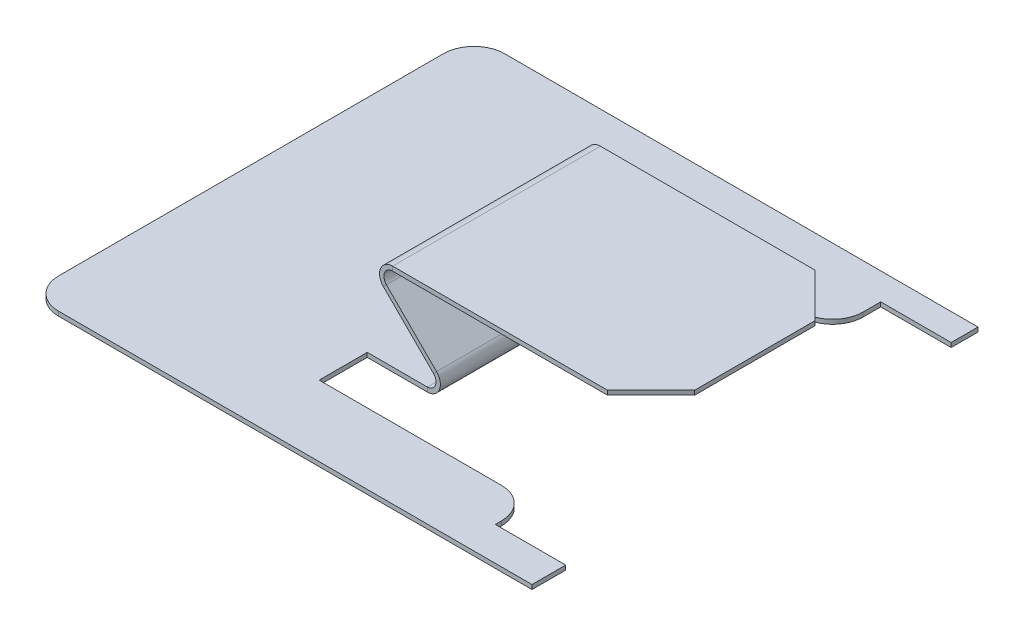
ISO-10303-21;
HEADER;
FILE_DESCRIPTION(('STEP AP214'),'2;1');
FILE_NAME('part.step','',(''),(''),'','','');
FILE_SCHEMA(('AUTOMOTIVE_DESIGN { 1 0 10303 214 1 1 1 1 }'));
ENDSEC;
DATA;
#1=APPLICATION_CONTEXT('core data for automotive mechanical design processes');
#2=APPLICATION_PROTOCOL_DEFINITION('international standard','automotive_design',2000,#1);
#3=PRODUCT_CONTEXT('',#1,'mechanical');
#4=PRODUCT('Part','Part','',(#3));
#5=PRODUCT_RELATED_PRODUCT_CATEGORY('part','',(#4));
#6=PRODUCT_DEFINITION_FORMATION('','',#4);
#7=PRODUCT_DEFINITION_CONTEXT('part definition',#1,'design');
#8=PRODUCT_DEFINITION('design','',#6,#7);
#9=PRODUCT_DEFINITION_SHAPE('','',#8);
#10=(LENGTH_UNIT() NAMED_UNIT(*) SI_UNIT(.MILLI.,.METRE.));
#11=(NAMED_UNIT(*) PLANE_ANGLE_UNIT() SI_UNIT($,.RADIAN.));
#12=(NAMED_UNIT(*) SI_UNIT($,.STERADIAN.) SOLID_ANGLE_UNIT());
#13=UNCERTAINTY_MEASURE_WITH_UNIT(LENGTH_MEASURE(1.E-05),#10,'distance_accuracy_value','');
#14=(GEOMETRIC_REPRESENTATION_CONTEXT(3) GLOBAL_UNCERTAINTY_ASSIGNED_CONTEXT((#13)) GLOBAL_UNIT_ASSIGNED_CONTEXT((#10,
#11,#12)) REPRESENTATION_CONTEXT('',''));
#15=CARTESIAN_POINT('',(0.,0.,0.));
#16=DIRECTION('',(0.,0.,1.));
#17=DIRECTION('',(1.,0.,0.));
#18=AXIS2_PLACEMENT_3D('',#15,#16,#17);
#19=CARTESIAN_POINT('',(24.2169050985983,36.4189178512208,41.4697311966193));
#20=DIRECTION('',(0.707106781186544,0.707106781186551,0.));
#21=DIRECTION('',(0.,0.,-1.));
#22=AXIS2_PLACEMENT_3D('',#19,#20,#21);
#23=PLANE('',#22);
#24=DIRECTION('',(-0.707106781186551,0.707106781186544,0.));
#25=VECTOR('',#24,1.);
#26=CARTESIAN_POINT('',(70.1039701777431,-9.46814722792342,22.0110102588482));
#27=LINE('',#26,#25);
#28=CARTESIAN_POINT('',(56.2216093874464,4.4142135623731,22.0110102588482));
#29=VERTEX_POINT('',#28);
#30=CARTESIAN_POINT('',(44.7571432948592,15.8786796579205,22.0110102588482));
#31=VERTEX_POINT('',#30);
#32=EDGE_CURVE('E434',#29,#31,#27,.T.);
#33=ORIENTED_EDGE('',*,*,#32,.T.);
#34=DIRECTION('',(0.,0.,-1.));
#35=VECTOR('',#34,1.);
#36=CARTESIAN_POINT('',(44.7571432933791,15.8786796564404,41.4697311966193));
#37=LINE('',#36,#35);
#38=CARTESIAN_POINT('',(44.7571432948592,15.8786796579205,-25.5547520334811));
#39=VERTEX_POINT('',#38);
#40=EDGE_CURVE('E273',#31,#39,#37,.T.);
#41=ORIENTED_EDGE('',*,*,#40,.T.);
#42=DIRECTION('',(0.707106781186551,-0.707106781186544,0.));
#43=VECTOR('',#42,1.);
#44=CARTESIAN_POINT('',(17.5497955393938,43.0860274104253,-25.5547520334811));
#45=LINE('',#44,#43);
#46=CARTESIAN_POINT('',(56.2216094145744,4.4142135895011,-25.5547520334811));
#47=VERTEX_POINT('',#46);
#48=EDGE_CURVE('E413',#39,#47,#45,.T.);
#49=ORIENTED_EDGE('',*,*,#48,.T.);
#50=DIRECTION('',(0.,0.,-1.));
#51=VECTOR('',#50,1.);
#52=CARTESIAN_POINT('',(56.2216093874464,4.41421356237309,41.4697311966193));
#53=LINE('',#52,#51);
#54=EDGE_CURVE('E409',#29,#47,#53,.T.);
#55=ORIENTED_EDGE('',*,*,#54,.F.);
#56=EDGE_LOOP('',(#33,#41,#49,#55));
#57=FACE_BOUND('',#56,.T.);
#58=ADVANCED_FACE('F38',(#57),#23,.F.);
#59=CARTESIAN_POINT('',(17.5497955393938,43.0860274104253,-25.5547520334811));
#60=DIRECTION('',(0.,0.,1.));
#61=DIRECTION('',(-0.707106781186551,0.707106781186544,0.));
#62=AXIS2_PLACEMENT_3D('',#59,#60,#61);
#63=PLANE('',#62);
#64=ORIENTED_EDGE('',*,*,#48,.F.);
#65=DIRECTION('',(0.707106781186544,0.707106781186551,0.));
#66=VECTOR('',#65,1.);
#67=CARTESIAN_POINT('',(44.757143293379,15.8786796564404,-25.5547520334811));
#68=LINE('',#67,#66);
#69=CARTESIAN_POINT('',(45.4642500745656,16.5857864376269,-25.5547520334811));
#70=VERTEX_POINT('',#69);
#71=EDGE_CURVE('E428',#39,#70,#68,.T.);
#72=ORIENTED_EDGE('',*,*,#71,.T.);
#73=DIRECTION('',(0.707106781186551,-0.707106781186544,0.));
#74=VECTOR('',#73,1.);
#75=CARTESIAN_POINT('',(18.2569023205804,43.7931341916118,-25.5547520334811));
#76=LINE('',#75,#74);
#77=CARTESIAN_POINT('',(56.9287161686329,5.12132034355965,-25.5547520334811));
#78=VERTEX_POINT('',#77);
#79=EDGE_CURVE('E432',#70,#78,#76,.T.);
#80=ORIENTED_EDGE('',*,*,#79,.T.);
#81=DIRECTION('',(0.707106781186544,0.707106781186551,0.));
#82=VECTOR('',#81,1.);
#83=CARTESIAN_POINT('',(56.2216093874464,4.4142135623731,-25.5547520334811));
#84=LINE('',#83,#82);
#85=EDGE_CURVE('E412',#47,#78,#84,.T.);
#86=ORIENTED_EDGE('',*,*,#85,.F.);
#87=EDGE_LOOP('',(#64,#72,#80,#86));
#88=FACE_BOUND('',#87,.T.);
#89=ADVANCED_FACE('F578',(#88),#63,.F.);
#90=CARTESIAN_POINT('',(70.1039701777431,-9.46814722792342,22.0110102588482));
#91=DIRECTION('',(0.,0.,-1.));
#92=DIRECTION('',(0.707106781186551,-0.707106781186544,0.));
#93=AXIS2_PLACEMENT_3D('',#90,#91,#92);
#94=PLANE('',#93);
#95=DIRECTION('',(-0.707106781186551,0.707106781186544,0.));
#96=VECTOR('',#95,1.);
#97=CARTESIAN_POINT('',(70.8110769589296,-8.76104044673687,22.0110102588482));
#98=LINE('',#97,#96);
#99=CARTESIAN_POINT('',(56.928716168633,5.12132034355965,22.0110102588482));
#100=VERTEX_POINT('',#99);
#101=CARTESIAN_POINT('',(45.4642500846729,16.5857864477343,22.0110102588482));
#102=VERTEX_POINT('',#101);
#103=EDGE_CURVE('E301',#100,#102,#98,.T.);
#104=ORIENTED_EDGE('',*,*,#103,.T.);
#105=DIRECTION('',(-0.707106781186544,-0.707106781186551,0.));
#106=VECTOR('',#105,1.);
#107=CARTESIAN_POINT('',(44.757143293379,15.8786796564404,22.0110102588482));
#108=LINE('',#107,#106);
#109=EDGE_CURVE('E423',#102,#31,#108,.T.);
#110=ORIENTED_EDGE('',*,*,#109,.T.);
#111=ORIENTED_EDGE('',*,*,#32,.F.);
#112=DIRECTION('',(-0.707106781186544,-0.707106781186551,0.));
#113=VECTOR('',#112,1.);
#114=CARTESIAN_POINT('',(56.2216093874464,4.4142135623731,22.0110102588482));
#115=LINE('',#114,#113);
#116=EDGE_CURVE('E419',#100,#29,#115,.T.);
#117=ORIENTED_EDGE('',*,*,#116,.F.);
#118=EDGE_LOOP('',(#104,#110,#111,#117));
#119=FACE_BOUND('',#118,.T.);
#120=ADVANCED_FACE('F584',(#119),#94,.F.);
#121=CARTESIAN_POINT('',(24.9240118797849,37.1260246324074,41.4697311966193));
#122=DIRECTION('',(0.707106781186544,0.707106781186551,0.));
#123=DIRECTION('',(0.,0.,-1.));
#124=AXIS2_PLACEMENT_3D('',#121,#122,#123);
#125=PLANE('',#124);
#126=DIRECTION('',(0.,0.,-1.));
#127=VECTOR('',#126,1.);
#128=CARTESIAN_POINT('',(45.4642500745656,16.5857864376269,41.4697311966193));
#129=LINE('',#128,#127);
#130=EDGE_CURVE('E426',#102,#70,#129,.T.);
#131=ORIENTED_EDGE('',*,*,#130,.F.);
#132=ORIENTED_EDGE('',*,*,#103,.F.);
#133=DIRECTION('',(0.,0.,-1.));
#134=VECTOR('',#133,1.);
#135=CARTESIAN_POINT('',(56.928716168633,5.12132034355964,41.4697311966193));
#136=LINE('',#135,#134);
#137=EDGE_CURVE('E416',#100,#78,#136,.T.);
#138=ORIENTED_EDGE('',*,*,#137,.T.);
#139=ORIENTED_EDGE('',*,*,#79,.F.);
#140=EDGE_LOOP('',(#131,#132,#138,#139));
#141=FACE_BOUND('',#140,.T.);
#142=ADVANCED_FACE('F592',(#141),#125,.T.);
#143=CARTESIAN_POINT('',(41.0652591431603,1.,33.0179635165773));
#144=DIRECTION('',(-1.,0.,0.));
#145=DIRECTION('',(0.,0.,1.));
#146=AXIS2_PLACEMENT_3D('',#143,#144,#145);
#147=PLANE('',#146);
#148=DIRECTION('',(0.,0.,-1.));
#149=VECTOR('',#148,1.);
#150=CARTESIAN_POINT('',(41.0652591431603,0.,33.0179635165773));
#151=LINE('',#150,#149);
#152=CARTESIAN_POINT('',(41.0652591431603,0.,33.0179635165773));
#153=VERTEX_POINT('',#152);
#154=CARTESIAN_POINT('',(41.0652591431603,0.,22.0110102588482));
#155=VERTEX_POINT('',#154);
#156=EDGE_CURVE('E406',#153,#155,#151,.T.);
#157=ORIENTED_EDGE('',*,*,#156,.T.);
#158=DIRECTION('',(0.,-1.,0.));
#159=VECTOR('',#158,1.);
#160=CARTESIAN_POINT('',(41.0652591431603,1.,22.0110102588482));
#161=LINE('',#160,#159);
#162=CARTESIAN_POINT('',(41.0652591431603,1.,22.0110102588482));
#163=VERTEX_POINT('',#162);
#164=EDGE_CURVE('E298',#163,#155,#161,.T.);
#165=ORIENTED_EDGE('',*,*,#164,.F.);
#166=DIRECTION('',(0.,0.,-1.));
#167=VECTOR('',#166,1.);
#168=CARTESIAN_POINT('',(41.0652591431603,1.,33.0179635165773));
#169=LINE('',#168,#167);
#170=CARTESIAN_POINT('',(41.0652591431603,1.,33.0179635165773));
#171=VERTEX_POINT('',#170);
#172=EDGE_CURVE('E313',#171,#163,#169,.T.);
#173=ORIENTED_EDGE('',*,*,#172,.F.);
#174=DIRECTION('',(0.,-1.,0.));
#175=VECTOR('',#174,1.);
#176=CARTESIAN_POINT('',(41.0652591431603,1.,33.0179635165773));
#177=LINE('',#176,#175);
#178=EDGE_CURVE('E403',#171,#153,#177,.T.);
#179=ORIENTED_EDGE('',*,*,#178,.T.);
#180=EDGE_LOOP('',(#157,#165,#173,#179));
#181=FACE_BOUND('',#180,.T.);
#182=ADVANCED_FACE('F500',(#181),#147,.F.);
#183=CARTESIAN_POINT('',(89.8362298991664,1.,33.0179635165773));
#184=DIRECTION('',(0.,0.,1.));
#185=DIRECTION('',(1.,0.,0.));
#186=AXIS2_PLACEMENT_3D('',#183,#184,#185);
#187=PLANE('',#186);
#188=DIRECTION('',(-1.,0.,0.));
#189=VECTOR('',#188,1.);
#190=CARTESIAN_POINT('',(89.8362298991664,1.,33.0179635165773));
#191=LINE('',#190,#189);
#192=CARTESIAN_POINT('',(82.8362298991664,1.,33.0179635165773));
#193=VERTEX_POINT('',#192);
#194=EDGE_CURVE('E315',#193,#171,#191,.T.);
#195=ORIENTED_EDGE('',*,*,#194,.F.);
#196=DIRECTION('',(0.,-1.,0.));
#197=VECTOR('',#196,1.);
#198=CARTESIAN_POINT('',(82.8362298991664,1.,33.0179635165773));
#199=LINE('',#198,#197);
#200=CARTESIAN_POINT('',(82.8362298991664,0.,33.0179635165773));
#201=VERTEX_POINT('',#200);
#202=EDGE_CURVE('E483',#193,#201,#199,.T.);
#203=ORIENTED_EDGE('',*,*,#202,.T.);
#204=DIRECTION('',(-1.,0.,0.));
#205=VECTOR('',#204,1.);
#206=CARTESIAN_POINT('',(89.8362298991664,0.,33.0179635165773));
#207=LINE('',#206,#205);
#208=EDGE_CURVE('E401',#201,#153,#207,.T.);
#209=ORIENTED_EDGE('',*,*,#208,.T.);
#210=ORIENTED_EDGE('',*,*,#178,.F.);
#211=EDGE_LOOP('',(#195,#203,#209,#210));
#212=FACE_BOUND('',#211,.T.);
#213=ADVANCED_FACE('F488',(#212),#187,.F.);
#214=CARTESIAN_POINT('',(89.8362298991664,1.,33.0179635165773));
#215=DIRECTION('',(-1.,0.,0.));
#216=DIRECTION('',(0.,0.,1.));
#217=AXIS2_PLACEMENT_3D('',#214,#215,#216);
#218=PLANE('',#217);
#219=DIRECTION('',(0.,0.,-1.));
#220=VECTOR('',#219,1.);
#221=CARTESIAN_POINT('',(89.8362298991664,0.,33.0179635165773));
#222=LINE('',#221,#220);
#223=CARTESIAN_POINT('',(89.8362298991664,0.,41.4697311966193));
#224=VERTEX_POINT('',#223);
#225=CARTESIAN_POINT('',(89.8362298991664,0.,40.0179635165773));
#226=VERTEX_POINT('',#225);
#227=EDGE_CURVE('E399',#224,#226,#222,.T.);
#228=ORIENTED_EDGE('',*,*,#227,.T.);
#229=DIRECTION('',(0.,-1.,0.));
#230=VECTOR('',#229,1.);
#231=CARTESIAN_POINT('',(89.8362298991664,1.,40.0179635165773));
#232=LINE('',#231,#230);
#233=CARTESIAN_POINT('',(89.8362298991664,1.,40.0179635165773));
#234=VERTEX_POINT('',#233);
#235=EDGE_CURVE('E46',#226,#234,#232,.F.);
#236=ORIENTED_EDGE('',*,*,#235,.T.);
#237=DIRECTION('',(0.,0.,-1.));
#238=VECTOR('',#237,1.);
#239=CARTESIAN_POINT('',(89.8362298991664,1.,33.0179635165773));
#240=LINE('',#239,#238);
#241=CARTESIAN_POINT('',(89.8362298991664,1.,41.4697311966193));
#242=VERTEX_POINT('',#241);
#243=EDGE_CURVE('E317',#242,#234,#240,.T.);
#244=ORIENTED_EDGE('',*,*,#243,.F.);
#245=DIRECTION('',(0.,-1.,0.));
#246=VECTOR('',#245,1.);
#247=CARTESIAN_POINT('',(89.8362298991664,1.,41.4697311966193));
#248=LINE('',#247,#246);
#249=EDGE_CURVE('E396',#242,#224,#248,.T.);
#250=ORIENTED_EDGE('',*,*,#249,.T.);
#251=EDGE_LOOP('',(#228,#236,#244,#250));
#252=FACE_BOUND('',#251,.T.);
#253=ADVANCED_FACE('F569',(#252),#218,.F.);
#254=CARTESIAN_POINT('',(89.8362298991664,1.,41.4697311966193));
#255=DIRECTION('',(0.,0.,1.));
#256=DIRECTION('',(1.,0.,0.));
#257=AXIS2_PLACEMENT_3D('',#254,#255,#256);
#258=PLANE('',#257);
#259=DIRECTION('',(-1.,0.,0.));
#260=VECTOR('',#259,1.);
#261=CARTESIAN_POINT('',(89.8362298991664,0.,41.4697311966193));
#262=LINE('',#261,#260);
#263=CARTESIAN_POINT('',(105.959368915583,0.,41.4697311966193));
#264=VERTEX_POINT('',#263);
#265=EDGE_CURVE('E394',#264,#224,#262,.T.);
#266=ORIENTED_EDGE('',*,*,#265,.T.);
#267=ORIENTED_EDGE('',*,*,#249,.F.);
#268=DIRECTION('',(-1.,0.,0.));
#269=VECTOR('',#268,1.);
#270=CARTESIAN_POINT('',(89.8362298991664,1.,41.4697311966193));
#271=LINE('',#270,#269);
#272=CARTESIAN_POINT('',(105.959368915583,1.,41.4697311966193));
#273=VERTEX_POINT('',#272);
#274=EDGE_CURVE('E319',#273,#242,#271,.T.);
#275=ORIENTED_EDGE('',*,*,#274,.F.);
#276=DIRECTION('',(0.,-1.,0.));
#277=VECTOR('',#276,1.);
#278=CARTESIAN_POINT('',(105.959368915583,1.,41.4697311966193));
#279=LINE('',#278,#277);
#280=EDGE_CURVE('E391',#273,#264,#279,.T.);
#281=ORIENTED_EDGE('',*,*,#280,.T.);
#282=EDGE_LOOP('',(#266,#267,#275,#281));
#283=FACE_BOUND('',#282,.T.);
#284=ADVANCED_FACE('F568',(#283),#258,.F.);
#285=CARTESIAN_POINT('',(105.959368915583,1.,49.1848728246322));
#286=DIRECTION('',(-1.,0.,0.));
#287=DIRECTION('',(0.,0.,1.));
#288=AXIS2_PLACEMENT_3D('',#285,#286,#287);
#289=PLANE('',#288);
#290=DIRECTION('',(0.,0.,-1.));
#291=VECTOR('',#290,1.);
#292=CARTESIAN_POINT('',(105.959368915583,0.,49.1848728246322));
#293=LINE('',#292,#291);
#294=CARTESIAN_POINT('',(105.959368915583,0.,49.1848728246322));
#295=VERTEX_POINT('',#294);
#296=EDGE_CURVE('E388',#295,#264,#293,.T.);
#297=ORIENTED_EDGE('',*,*,#296,.T.);
#298=ORIENTED_EDGE('',*,*,#280,.F.);
#299=DIRECTION('',(0.,0.,-1.));
#300=VECTOR('',#299,1.);
#301=CARTESIAN_POINT('',(105.959368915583,1.,49.1848728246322));
#302=LINE('',#301,#300);
#303=CARTESIAN_POINT('',(105.959368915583,1.,49.1848728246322));
#304=VERTEX_POINT('',#303);
#305=EDGE_CURVE('E321',#304,#273,#302,.T.);
#306=ORIENTED_EDGE('',*,*,#305,.F.);
#307=DIRECTION('',(0.,-1.,0.));
#308=VECTOR('',#307,1.);
#309=CARTESIAN_POINT('',(105.959368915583,1.,49.1848728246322));
#310=LINE('',#309,#308);
#311=EDGE_CURVE('E385',#304,#295,#310,.T.);
#312=ORIENTED_EDGE('',*,*,#311,.T.);
#313=EDGE_LOOP('',(#297,#298,#306,#312));
#314=FACE_BOUND('',#313,.T.);
#315=ADVANCED_FACE('F566',(#314),#289,.F.);
#316=CARTESIAN_POINT('',(105.959368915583,1.,49.1848728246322));
#317=DIRECTION('',(0.,0.,-1.));
#318=DIRECTION('',(-1.,0.,0.));
#319=AXIS2_PLACEMENT_3D('',#316,#317,#318);
#320=PLANE('',#319);
#321=DIRECTION('',(1.,0.,0.));
#322=VECTOR('',#321,1.);
#323=CARTESIAN_POINT('',(105.959368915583,1.,49.1848728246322));
#324=LINE('',#323,#322);
#325=CARTESIAN_POINT('',(-2.42871676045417,1.,49.1848728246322));
#326=VERTEX_POINT('',#325);
#327=EDGE_CURVE('E324',#326,#304,#324,.T.);
#328=ORIENTED_EDGE('',*,*,#327,.F.);
#329=DIRECTION('',(0.,-1.,0.));
#330=VECTOR('',#329,1.);
#331=CARTESIAN_POINT('',(-2.4287167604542,1.,49.1848728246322));
#332=LINE('',#331,#330);
#333=CARTESIAN_POINT('',(-2.42871676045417,0.,49.1848728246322));
#334=VERTEX_POINT('',#333);
#335=EDGE_CURVE('E12',#326,#334,#332,.T.);
#336=ORIENTED_EDGE('',*,*,#335,.T.);
#337=DIRECTION('',(1.,0.,0.));
#338=VECTOR('',#337,1.);
#339=CARTESIAN_POINT('',(105.959368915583,0.,49.1848728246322));
#340=LINE('',#339,#338);
#341=EDGE_CURVE('E383',#334,#295,#340,.T.);
#342=ORIENTED_EDGE('',*,*,#341,.T.);
#343=ORIENTED_EDGE('',*,*,#311,.F.);
#344=EDGE_LOOP('',(#328,#336,#342,#343));
#345=FACE_BOUND('',#344,.T.);
#346=ADVANCED_FACE('F560',(#345),#320,.F.);
#347=CARTESIAN_POINT('',(-9.4287167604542,1.,49.1848728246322));
#348=DIRECTION('',(1.,0.,0.));
#349=DIRECTION('',(0.,0.,-1.));
#350=AXIS2_PLACEMENT_3D('',#347,#348,#349);
#351=PLANE('',#350);
#352=DIRECTION('',(0.,0.,1.));
#353=VECTOR('',#352,1.);
#354=CARTESIAN_POINT('',(-9.4287167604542,1.,49.1848728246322));
#355=LINE('',#354,#353);
#356=CARTESIAN_POINT('',(-9.4287167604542,1.,-45.9251673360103));
#357=VERTEX_POINT('',#356);
#358=CARTESIAN_POINT('',(-9.4287167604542,1.,42.1848728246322));
#359=VERTEX_POINT('',#358);
#360=EDGE_CURVE('E326',#357,#359,#355,.T.);
#361=ORIENTED_EDGE('',*,*,#360,.F.);
#362=DIRECTION('',(0.,-1.,0.));
#363=VECTOR('',#362,1.);
#364=CARTESIAN_POINT('',(-9.4287167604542,1.,-45.9251673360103));
#365=LINE('',#364,#363);
#366=CARTESIAN_POINT('',(-9.4287167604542,0.,-45.9251673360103));
#367=VERTEX_POINT('',#366);
#368=EDGE_CURVE('E458',#357,#367,#365,.T.);
#369=ORIENTED_EDGE('',*,*,#368,.T.);
#370=DIRECTION('',(0.,0.,1.));
#371=VECTOR('',#370,1.);
#372=CARTESIAN_POINT('',(-9.4287167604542,0.,49.1848728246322));
#373=LINE('',#372,#371);
#374=CARTESIAN_POINT('',(-9.4287167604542,0.,42.1848728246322));
#375=VERTEX_POINT('',#374);
#376=EDGE_CURVE('E380',#367,#375,#373,.T.);
#377=ORIENTED_EDGE('',*,*,#376,.T.);
#378=DIRECTION('',(0.,-1.,0.));
#379=VECTOR('',#378,1.);
#380=CARTESIAN_POINT('',(-9.4287167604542,1.,42.1848728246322));
#381=LINE('',#380,#379);
#382=EDGE_CURVE('E456',#375,#359,#381,.F.);
#383=ORIENTED_EDGE('',*,*,#382,.T.);
#384=EDGE_LOOP('',(#361,#369,#377,#383));
#385=FACE_BOUND('',#384,.T.);
#386=ADVANCED_FACE('F551',(#385),#351,.F.);
#387=CARTESIAN_POINT('',(105.959368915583,1.,-52.9251673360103));
#388=DIRECTION('',(0.,0.,1.));
#389=DIRECTION('',(1.,0.,0.));
#390=AXIS2_PLACEMENT_3D('',#387,#388,#389);
#391=PLANE('',#390);
#392=DIRECTION('',(-1.,0.,0.));
#393=VECTOR('',#392,1.);
#394=CARTESIAN_POINT('',(105.959368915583,0.,-52.9251673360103));
#395=LINE('',#394,#393);
#396=CARTESIAN_POINT('',(105.959368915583,0.,-52.9251673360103));
#397=VERTEX_POINT('',#396);
#398=CARTESIAN_POINT('',(-2.42871676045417,0.,-52.9251673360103));
#399=VERTEX_POINT('',#398);
#400=EDGE_CURVE('E377',#397,#399,#395,.T.);
#401=ORIENTED_EDGE('',*,*,#400,.T.);
#402=DIRECTION('',(0.,-1.,0.));
#403=VECTOR('',#402,1.);
#404=CARTESIAN_POINT('',(-2.4287167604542,1.,-52.9251673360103));
#405=LINE('',#404,#403);
#406=CARTESIAN_POINT('',(-2.42871676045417,1.,-52.9251673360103));
#407=VERTEX_POINT('',#406);
#408=EDGE_CURVE('E469',#399,#407,#405,.F.);
#409=ORIENTED_EDGE('',*,*,#408,.T.);
#410=DIRECTION('',(-1.,0.,0.));
#411=VECTOR('',#410,1.);
#412=CARTESIAN_POINT('',(105.959368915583,1.,-52.9251673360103));
#413=LINE('',#412,#411);
#414=CARTESIAN_POINT('',(105.959368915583,1.,-52.9251673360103));
#415=VERTEX_POINT('',#414);
#416=EDGE_CURVE('E329',#415,#407,#413,.T.);
#417=ORIENTED_EDGE('',*,*,#416,.F.);
#418=DIRECTION('',(0.,-1.,0.));
#419=VECTOR('',#418,1.);
#420=CARTESIAN_POINT('',(105.959368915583,1.,-52.9251673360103));
#421=LINE('',#420,#419);
#422=EDGE_CURVE('E374',#415,#397,#421,.T.);
#423=ORIENTED_EDGE('',*,*,#422,.T.);
#424=EDGE_LOOP('',(#401,#409,#417,#423));
#425=FACE_BOUND('',#424,.T.);
#426=ADVANCED_FACE('F850',(#425),#391,.F.);
#427=CARTESIAN_POINT('',(105.959368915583,1.,-46.7824476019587));
#428=DIRECTION('',(-1.,0.,0.));
#429=DIRECTION('',(0.,0.,1.));
#430=AXIS2_PLACEMENT_3D('',#427,#428,#429);
#431=PLANE('',#430);
#432=DIRECTION('',(0.,0.,-1.));
#433=VECTOR('',#432,1.);
#434=CARTESIAN_POINT('',(105.959368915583,0.,-46.7824476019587));
#435=LINE('',#434,#433);
#436=CARTESIAN_POINT('',(105.959368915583,0.,-46.7824476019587));
#437=VERTEX_POINT('',#436);
#438=EDGE_CURVE('E372',#437,#397,#435,.T.);
#439=ORIENTED_EDGE('',*,*,#438,.T.);
#440=ORIENTED_EDGE('',*,*,#422,.F.);
#441=DIRECTION('',(0.,0.,-1.));
#442=VECTOR('',#441,1.);
#443=CARTESIAN_POINT('',(105.959368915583,1.,-46.7824476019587));
#444=LINE('',#443,#442);
#445=CARTESIAN_POINT('',(105.959368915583,1.,-46.7824476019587));
#446=VERTEX_POINT('',#445);
#447=EDGE_CURVE('E332',#446,#415,#444,.T.);
#448=ORIENTED_EDGE('',*,*,#447,.F.);
#449=DIRECTION('',(0.,-1.,0.));
#450=VECTOR('',#449,1.);
#451=CARTESIAN_POINT('',(105.959368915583,1.,-46.7824476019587));
#452=LINE('',#451,#450);
#453=EDGE_CURVE('E369',#446,#437,#452,.T.);
#454=ORIENTED_EDGE('',*,*,#453,.T.);
#455=EDGE_LOOP('',(#439,#440,#448,#454));
#456=FACE_BOUND('',#455,.T.);
#457=ADVANCED_FACE('F540',(#456),#431,.F.);
#458=CARTESIAN_POINT('',(89.8362298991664,1.,-46.7824476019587));
#459=DIRECTION('',(0.,0.,-1.));
#460=DIRECTION('',(-1.,0.,0.));
#461=AXIS2_PLACEMENT_3D('',#458,#459,#460);
#462=PLANE('',#461);
#463=DIRECTION('',(1.,0.,0.));
#464=VECTOR('',#463,1.);
#465=CARTESIAN_POINT('',(89.8362298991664,0.,-46.7824476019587));
#466=LINE('',#465,#464);
#467=CARTESIAN_POINT('',(89.8362298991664,0.,-46.7824476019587));
#468=VERTEX_POINT('',#467);
#469=EDGE_CURVE('E367',#468,#437,#466,.T.);
#470=ORIENTED_EDGE('',*,*,#469,.T.);
#471=ORIENTED_EDGE('',*,*,#453,.F.);
#472=DIRECTION('',(1.,0.,0.));
#473=VECTOR('',#472,1.);
#474=CARTESIAN_POINT('',(89.8362298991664,1.,-46.7824476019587));
#475=LINE('',#474,#473);
#476=CARTESIAN_POINT('',(89.8362298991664,1.,-46.7824476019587));
#477=VERTEX_POINT('',#476);
#478=EDGE_CURVE('E334',#477,#446,#475,.T.);
#479=ORIENTED_EDGE('',*,*,#478,.F.);
#480=DIRECTION('',(0.,-1.,0.));
#481=VECTOR('',#480,1.);
#482=CARTESIAN_POINT('',(89.8362298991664,1.,-46.7824476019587));
#483=LINE('',#482,#481);
#484=EDGE_CURVE('E364',#477,#468,#483,.T.);
#485=ORIENTED_EDGE('',*,*,#484,.T.);
#486=EDGE_LOOP('',(#470,#471,#479,#485));
#487=FACE_BOUND('',#486,.T.);
#488=ADVANCED_FACE('F536',(#487),#462,.F.);
#489=CARTESIAN_POINT('',(89.8362298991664,1.,-35.7754943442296));
#490=DIRECTION('',(-1.,0.,0.));
#491=DIRECTION('',(0.,0.,1.));
#492=AXIS2_PLACEMENT_3D('',#489,#490,#491);
#493=PLANE('',#492);
#494=DIRECTION('',(0.,0.,-1.));
#495=VECTOR('',#494,1.);
#496=CARTESIAN_POINT('',(89.8362298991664,1.,-35.7754943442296));
#497=LINE('',#496,#495);
#498=CARTESIAN_POINT('',(89.8362298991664,1.,-42.7754943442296));
#499=VERTEX_POINT('',#498);
#500=EDGE_CURVE('E336',#499,#477,#497,.T.);
#501=ORIENTED_EDGE('',*,*,#500,.F.);
#502=DIRECTION('',(0.,-1.,0.));
#503=VECTOR('',#502,1.);
#504=CARTESIAN_POINT('',(89.8362298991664,1.,-42.7754943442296));
#505=LINE('',#504,#503);
#506=CARTESIAN_POINT('',(89.8362298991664,0.,-42.7754943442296));
#507=VERTEX_POINT('',#506);
#508=EDGE_CURVE('E478',#499,#507,#505,.T.);
#509=ORIENTED_EDGE('',*,*,#508,.T.);
#510=DIRECTION('',(0.,0.,-1.));
#511=VECTOR('',#510,1.);
#512=CARTESIAN_POINT('',(89.8362298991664,0.,-35.7754943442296));
#513=LINE('',#512,#511);
#514=EDGE_CURVE('E362',#507,#468,#513,.T.);
#515=ORIENTED_EDGE('',*,*,#514,.T.);
#516=ORIENTED_EDGE('',*,*,#484,.F.);
#517=EDGE_LOOP('',(#501,#509,#515,#516));
#518=FACE_BOUND('',#517,.T.);
#519=ADVANCED_FACE('F528',(#518),#493,.F.);
#520=CARTESIAN_POINT('',(41.0652591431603,1.,-35.7754943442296));
#521=DIRECTION('',(0.,0.,-1.));
#522=DIRECTION('',(-1.,0.,0.));
#523=AXIS2_PLACEMENT_3D('',#520,#521,#522);
#524=PLANE('',#523);
#525=DIRECTION('',(1.,0.,0.));
#526=VECTOR('',#525,1.);
#527=CARTESIAN_POINT('',(41.0652591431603,0.,-35.7754943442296));
#528=LINE('',#527,#526);
#529=CARTESIAN_POINT('',(41.0652591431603,0.,-35.7754943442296));
#530=VERTEX_POINT('',#529);
#531=CARTESIAN_POINT('',(82.8362298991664,0.,-35.7754943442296));
#532=VERTEX_POINT('',#531);
#533=EDGE_CURVE('E359',#530,#532,#528,.T.);
#534=ORIENTED_EDGE('',*,*,#533,.T.);
#535=DIRECTION('',(0.,-1.,0.));
#536=VECTOR('',#535,1.);
#537=CARTESIAN_POINT('',(82.8362298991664,1.,-35.7754943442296));
#538=LINE('',#537,#536);
#539=CARTESIAN_POINT('',(82.8362298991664,1.,-35.7754943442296));
#540=VERTEX_POINT('',#539);
#541=EDGE_CURVE('E481',#532,#540,#538,.F.);
#542=ORIENTED_EDGE('',*,*,#541,.T.);
#543=DIRECTION('',(1.,0.,0.));
#544=VECTOR('',#543,1.);
#545=CARTESIAN_POINT('',(41.0652591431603,1.,-35.7754943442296));
#546=LINE('',#545,#544);
#547=CARTESIAN_POINT('',(41.0652591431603,1.,-35.7754943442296));
#548=VERTEX_POINT('',#547);
#549=EDGE_CURVE('E338',#548,#540,#546,.T.);
#550=ORIENTED_EDGE('',*,*,#549,.F.);
#551=DIRECTION('',(0.,-1.,0.));
#552=VECTOR('',#551,1.);
#553=CARTESIAN_POINT('',(41.0652591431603,1.,-35.7754943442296));
#554=LINE('',#553,#552);
#555=EDGE_CURVE('E356',#548,#530,#554,.T.);
#556=ORIENTED_EDGE('',*,*,#555,.T.);
#557=EDGE_LOOP('',(#534,#542,#550,#556));
#558=FACE_BOUND('',#557,.T.);
#559=ADVANCED_FACE('F812',(#558),#524,.F.);
#560=CARTESIAN_POINT('',(41.0652591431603,1.,-25.5547520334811));
#561=DIRECTION('',(-1.,0.,0.));
#562=DIRECTION('',(0.,0.,1.));
#563=AXIS2_PLACEMENT_3D('',#560,#561,#562);
#564=PLANE('',#563);
#565=DIRECTION('',(0.,0.,-1.));
#566=VECTOR('',#565,1.);
#567=CARTESIAN_POINT('',(41.0652591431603,0.,-25.5547520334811));
#568=LINE('',#567,#566);
#569=CARTESIAN_POINT('',(41.0652591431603,0.,-25.5547520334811));
#570=VERTEX_POINT('',#569);
#571=EDGE_CURVE('E354',#570,#530,#568,.T.);
#572=ORIENTED_EDGE('',*,*,#571,.T.);
#573=ORIENTED_EDGE('',*,*,#555,.F.);
#574=DIRECTION('',(0.,0.,-1.));
#575=VECTOR('',#574,1.);
#576=CARTESIAN_POINT('',(41.0652591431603,1.,-25.5547520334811));
#577=LINE('',#576,#575);
#578=CARTESIAN_POINT('',(41.0652591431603,1.,-25.5547520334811));
#579=VERTEX_POINT('',#578);
#580=EDGE_CURVE('E341',#579,#548,#577,.T.);
#581=ORIENTED_EDGE('',*,*,#580,.F.);
#582=DIRECTION('',(0.,-1.,0.));
#583=VECTOR('',#582,1.);
#584=CARTESIAN_POINT('',(41.0652591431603,1.,-25.5547520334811));
#585=LINE('',#584,#583);
#586=EDGE_CURVE('E351',#579,#570,#585,.T.);
#587=ORIENTED_EDGE('',*,*,#586,.T.);
#588=EDGE_LOOP('',(#572,#573,#581,#587));
#589=FACE_BOUND('',#588,.T.);
#590=ADVANCED_FACE('F517',(#589),#564,.F.);
#591=CARTESIAN_POINT('',(105.959368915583,1.,41.4697311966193));
#592=DIRECTION('',(0.,-1.,0.));
#593=DIRECTION('',(0.,0.,-1.));
#594=AXIS2_PLACEMENT_3D('',#591,#592,#593);
#595=PLANE('',#594);
#596=ORIENTED_EDGE('',*,*,#416,.T.);
#597=CARTESIAN_POINT('',(-2.4287167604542,1.,-45.9251673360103));
#598=DIRECTION('',(0.,-1.,0.));
#599=DIRECTION('',(0.,0.,-1.));
#600=AXIS2_PLACEMENT_3D('',#597,#598,#599);
#601=CIRCLE('',#600,7.);
#602=EDGE_CURVE('E476',#407,#357,#601,.F.);
#603=ORIENTED_EDGE('',*,*,#602,.T.);
#604=ORIENTED_EDGE('',*,*,#360,.T.);
#605=CARTESIAN_POINT('',(-2.4287167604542,1.,42.1848728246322));
#606=DIRECTION('',(0.,-1.,0.));
#607=DIRECTION('',(0.,0.,-1.));
#608=AXIS2_PLACEMENT_3D('',#605,#606,#607);
#609=CIRCLE('',#608,7.);
#610=EDGE_CURVE('E471',#359,#326,#609,.F.);
#611=ORIENTED_EDGE('',*,*,#610,.T.);
#612=ORIENTED_EDGE('',*,*,#327,.T.);
#613=ORIENTED_EDGE('',*,*,#305,.T.);
#614=ORIENTED_EDGE('',*,*,#274,.T.);
#615=ORIENTED_EDGE('',*,*,#243,.T.);
#616=CARTESIAN_POINT('',(82.8362298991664,1.,40.0179635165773));
#617=DIRECTION('',(0.,-1.,0.));
#618=DIRECTION('',(0.,0.,-1.));
#619=AXIS2_PLACEMENT_3D('',#616,#617,#618);
#620=CIRCLE('',#619,7.);
#621=EDGE_CURVE('E53',#234,#193,#620,.F.);
#622=ORIENTED_EDGE('',*,*,#621,.T.);
#623=ORIENTED_EDGE('',*,*,#194,.T.);
#624=ORIENTED_EDGE('',*,*,#172,.T.);
#625=DIRECTION('',(1.,0.,0.));
#626=VECTOR('',#625,1.);
#627=CARTESIAN_POINT('',(41.0652591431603,1.,22.0110102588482));
#628=LINE('',#627,#626);
#629=CARTESIAN_POINT('',(54.8073958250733,0.999999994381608,22.0110102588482));
#630=VERTEX_POINT('',#629);
#631=EDGE_CURVE('E348',#163,#630,#628,.T.);
#632=ORIENTED_EDGE('',*,*,#631,.T.);
#633=DIRECTION('',(0.,0.,-1.));
#634=VECTOR('',#633,1.);
#635=CARTESIAN_POINT('',(54.8073958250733,1.,41.4697311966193));
#636=LINE('',#635,#634);
#637=CARTESIAN_POINT('',(54.8073958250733,0.999999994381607,-25.5547520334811));
#638=VERTEX_POINT('',#637);
#639=EDGE_CURVE('E345',#630,#638,#636,.T.);
#640=ORIENTED_EDGE('',*,*,#639,.T.);
#641=DIRECTION('',(-1.,0.,0.));
#642=VECTOR('',#641,1.);
#643=CARTESIAN_POINT('',(115.388085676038,1.,-25.5547520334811));
#644=LINE('',#643,#642);
#645=EDGE_CURVE('E343',#638,#579,#644,.T.);
#646=ORIENTED_EDGE('',*,*,#645,.T.);
#647=ORIENTED_EDGE('',*,*,#580,.T.);
#648=ORIENTED_EDGE('',*,*,#549,.T.);
#649=CARTESIAN_POINT('',(82.8362298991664,1.,-42.7754943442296));
#650=DIRECTION('',(0.,-1.,0.));
#651=DIRECTION('',(0.,0.,-1.));
#652=AXIS2_PLACEMENT_3D('',#649,#650,#651);
#653=CIRCLE('',#652,7.);
#654=EDGE_CURVE('E474',#540,#499,#653,.F.);
#655=ORIENTED_EDGE('',*,*,#654,.T.);
#656=ORIENTED_EDGE('',*,*,#500,.T.);
#657=ORIENTED_EDGE('',*,*,#478,.T.);
#658=ORIENTED_EDGE('',*,*,#447,.T.);
#659=EDGE_LOOP('',(#596,#603,#604,#611,#612,#613,#614,#615,#622,#623,#624,#632,#640,#646,#647,
#648,#655,#656,#657,#658));
#660=FACE_BOUND('',#659,.T.);
#661=ADVANCED_FACE('F505',(#660),#595,.F.);
#662=CARTESIAN_POINT('',(115.388085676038,1.,-25.5547520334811));
#663=DIRECTION('',(0.,0.,1.));
#664=DIRECTION('',(1.,0.,0.));
#665=AXIS2_PLACEMENT_3D('',#662,#663,#664);
#666=PLANE('',#665);
#667=ORIENTED_EDGE('',*,*,#645,.F.);
#668=DIRECTION('',(0.,-1.,0.));
#669=VECTOR('',#668,1.);
#670=CARTESIAN_POINT('',(54.8073958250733,1.,-25.5547520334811));
#671=LINE('',#670,#669);
#672=CARTESIAN_POINT('',(54.8073958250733,0.,-25.5547520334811));
#673=VERTEX_POINT('',#672);
#674=EDGE_CURVE('E310',#638,#673,#671,.T.);
#675=ORIENTED_EDGE('',*,*,#674,.T.);
#676=DIRECTION('',(-1.,0.,0.));
#677=VECTOR('',#676,1.);
#678=CARTESIAN_POINT('',(115.388085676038,0.,-25.5547520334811));
#679=LINE('',#678,#677);
#680=EDGE_CURVE('E308',#673,#570,#679,.T.);
#681=ORIENTED_EDGE('',*,*,#680,.T.);
#682=ORIENTED_EDGE('',*,*,#586,.F.);
#683=EDGE_LOOP('',(#667,#675,#681,#682));
#684=FACE_BOUND('',#683,.T.);
#685=ADVANCED_FACE('F511',(#684),#666,.F.);
#686=CARTESIAN_POINT('',(105.959368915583,0.,41.4697311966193));
#687=DIRECTION('',(0.,-1.,0.));
#688=DIRECTION('',(0.,0.,-1.));
#689=AXIS2_PLACEMENT_3D('',#686,#687,#688);
#690=PLANE('',#689);
#691=ORIENTED_EDGE('',*,*,#376,.F.);
#692=CARTESIAN_POINT('',(-2.4287167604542,0.,-45.9251673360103));
#693=DIRECTION('',(0.,-1.,0.));
#694=DIRECTION('',(0.,0.,-1.));
#695=AXIS2_PLACEMENT_3D('',#692,#693,#694);
#696=CIRCLE('',#695,7.);
#697=EDGE_CURVE('E467',#367,#399,#696,.T.);
#698=ORIENTED_EDGE('',*,*,#697,.T.);
#699=ORIENTED_EDGE('',*,*,#400,.F.);
#700=ORIENTED_EDGE('',*,*,#438,.F.);
#701=ORIENTED_EDGE('',*,*,#469,.F.);
#702=ORIENTED_EDGE('',*,*,#514,.F.);
#703=CARTESIAN_POINT('',(82.8362298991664,0.,-42.7754943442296));
#704=DIRECTION('',(0.,-1.,0.));
#705=DIRECTION('',(0.,0.,-1.));
#706=AXIS2_PLACEMENT_3D('',#703,#704,#705);
#707=CIRCLE('',#706,7.);
#708=EDGE_CURVE('E465',#507,#532,#707,.T.);
#709=ORIENTED_EDGE('',*,*,#708,.T.);
#710=ORIENTED_EDGE('',*,*,#533,.F.);
#711=ORIENTED_EDGE('',*,*,#571,.F.);
#712=ORIENTED_EDGE('',*,*,#680,.F.);
#713=DIRECTION('',(0.,0.,-1.));
#714=VECTOR('',#713,1.);
#715=CARTESIAN_POINT('',(54.8073958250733,0.,41.4697311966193));
#716=LINE('',#715,#714);
#717=CARTESIAN_POINT('',(54.8073958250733,-3.83647961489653E-08,22.0110102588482));
#718=VERTEX_POINT('',#717);
#719=EDGE_CURVE('E293',#718,#673,#716,.T.);
#720=ORIENTED_EDGE('',*,*,#719,.F.);
#721=DIRECTION('',(1.,0.,0.));
#722=VECTOR('',#721,1.);
#723=CARTESIAN_POINT('',(41.0652591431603,0.,22.0110102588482));
#724=LINE('',#723,#722);
#725=EDGE_CURVE('E305',#155,#718,#724,.T.);
#726=ORIENTED_EDGE('',*,*,#725,.F.);
#727=ORIENTED_EDGE('',*,*,#156,.F.);
#728=ORIENTED_EDGE('',*,*,#208,.F.);
#729=CARTESIAN_POINT('',(82.8362298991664,0.,40.0179635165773));
#730=DIRECTION('',(0.,-1.,0.));
#731=DIRECTION('',(0.,0.,-1.));
#732=AXIS2_PLACEMENT_3D('',#729,#730,#731);
#733=CIRCLE('',#732,7.);
#734=EDGE_CURVE('E463',#201,#226,#733,.T.);
#735=ORIENTED_EDGE('',*,*,#734,.T.);
#736=ORIENTED_EDGE('',*,*,#227,.F.);
#737=ORIENTED_EDGE('',*,*,#265,.F.);
#738=ORIENTED_EDGE('',*,*,#296,.F.);
#739=ORIENTED_EDGE('',*,*,#341,.F.);
#740=CARTESIAN_POINT('',(-2.4287167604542,0.,42.1848728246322));
#741=DIRECTION('',(0.,-1.,0.));
#742=DIRECTION('',(0.,0.,-1.));
#743=AXIS2_PLACEMENT_3D('',#740,#741,#742);
#744=CIRCLE('',#743,7.);
#745=EDGE_CURVE('E461',#334,#375,#744,.T.);
#746=ORIENTED_EDGE('',*,*,#745,.T.);
#747=EDGE_LOOP('',(#691,#698,#699,#700,#701,#702,#709,#710,#711,#712,#720,#726,#727,#728,#735,
#736,#737,#738,#739,#746));
#748=FACE_BOUND('',#747,.T.);
#749=ADVANCED_FACE('F494',(#748),#690,.T.);
#750=CARTESIAN_POINT('',(41.0652591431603,1.,22.0110102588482));
#751=DIRECTION('',(0.,0.,-1.));
#752=DIRECTION('',(-1.,0.,0.));
#753=AXIS2_PLACEMENT_3D('',#750,#751,#752);
#754=PLANE('',#753);
#755=ORIENTED_EDGE('',*,*,#725,.T.);
#756=DIRECTION('',(0.,1.,0.));
#757=VECTOR('',#756,1.);
#758=CARTESIAN_POINT('',(54.8073958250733,1.,22.0110102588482));
#759=LINE('',#758,#757);
#760=EDGE_CURVE('E302',#718,#630,#759,.T.);
#761=ORIENTED_EDGE('',*,*,#760,.T.);
#762=ORIENTED_EDGE('',*,*,#631,.F.);
#763=ORIENTED_EDGE('',*,*,#164,.T.);
#764=EDGE_LOOP('',(#755,#761,#762,#763));
#765=FACE_BOUND('',#764,.T.);
#766=ADVANCED_FACE('F504',(#765),#754,.F.);
#767=CARTESIAN_POINT('',(54.8073958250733,3.0000000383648,22.0110102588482));
#768=DIRECTION('',(0.,0.,-1.));
#769=DIRECTION('',(-1.,0.,0.));
#770=AXIS2_PLACEMENT_3D('',#767,#768,#769);
#771=PLANE('',#770);
#772=ORIENTED_EDGE('',*,*,#760,.F.);
#773=CARTESIAN_POINT('',(54.8073958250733,3.,22.0110102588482));
#774=DIRECTION('',(0.,0.,-1.));
#775=DIRECTION('',(-1.,0.,0.));
#776=AXIS2_PLACEMENT_3D('',#773,#774,#775);
#777=CIRCLE('',#776,3.0000000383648);
#778=EDGE_CURVE('E278',#718,#100,#777,.F.);
#779=ORIENTED_EDGE('',*,*,#778,.T.);
#780=ORIENTED_EDGE('',*,*,#116,.T.);
#781=CARTESIAN_POINT('',(54.8073958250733,3.0000000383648,22.0110102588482));
#782=DIRECTION('',(0.,0.,1.));
#783=DIRECTION('',(1.,0.,0.));
#784=AXIS2_PLACEMENT_3D('',#781,#782,#783);
#785=CIRCLE('',#784,2.00000004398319);
#786=EDGE_CURVE('E286',#630,#29,#785,.T.);
#787=ORIENTED_EDGE('',*,*,#786,.F.);
#788=EDGE_LOOP('',(#772,#779,#780,#787));
#789=FACE_BOUND('',#788,.T.);
#790=ADVANCED_FACE('F762',(#789),#771,.F.);
#791=CARTESIAN_POINT('',(54.8073958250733,3.0000000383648,-25.5547520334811));
#792=DIRECTION('',(0.,0.,1.));
#793=DIRECTION('',(1.,0.,0.));
#794=AXIS2_PLACEMENT_3D('',#791,#792,#793);
#795=PLANE('',#794);
#796=ORIENTED_EDGE('',*,*,#85,.T.);
#797=CARTESIAN_POINT('',(54.8073958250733,3.,-25.5547520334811));
#798=DIRECTION('',(0.,0.,-1.));
#799=DIRECTION('',(-1.,0.,0.));
#800=AXIS2_PLACEMENT_3D('',#797,#798,#799);
#801=CIRCLE('',#800,3.0000000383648);
#802=EDGE_CURVE('E290',#78,#673,#801,.T.);
#803=ORIENTED_EDGE('',*,*,#802,.T.);
#804=ORIENTED_EDGE('',*,*,#674,.F.);
#805=CARTESIAN_POINT('',(54.8073958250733,3.0000000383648,-25.5547520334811));
#806=DIRECTION('',(0.,0.,-1.));
#807=DIRECTION('',(-1.,0.,0.));
#808=AXIS2_PLACEMENT_3D('',#805,#806,#807);
#809=CIRCLE('',#808,2.00000004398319);
#810=EDGE_CURVE('E289',#47,#638,#809,.T.);
#811=ORIENTED_EDGE('',*,*,#810,.F.);
#812=EDGE_LOOP('',(#796,#803,#804,#811));
#813=FACE_BOUND('',#812,.T.);
#814=ADVANCED_FACE('F753',(#813),#795,.F.);
#815=CARTESIAN_POINT('',(54.8073958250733,3.,46.1676698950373));
#816=DIRECTION('',(0.,0.,-1.));
#817=DIRECTION('',(-1.,0.,0.));
#818=AXIS2_PLACEMENT_3D('',#815,#816,#817);
#819=CYLINDRICAL_SURFACE('',#818,2.0000000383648);
#820=ORIENTED_EDGE('',*,*,#810,.T.);
#821=ORIENTED_EDGE('',*,*,#639,.F.);
#822=ORIENTED_EDGE('',*,*,#786,.T.);
#823=ORIENTED_EDGE('',*,*,#54,.T.);
#824=EDGE_LOOP('',(#820,#821,#822,#823));
#825=FACE_BOUND('',#824,.T.);
#826=ADVANCED_FACE('F743',(#825),#819,.F.);
#827=CARTESIAN_POINT('',(54.8073958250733,3.,46.1676698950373));
#828=DIRECTION('',(0.,0.,-1.));
#829=DIRECTION('',(-1.,0.,0.));
#830=AXIS2_PLACEMENT_3D('',#827,#828,#829);
#831=CYLINDRICAL_SURFACE('',#830,3.0000000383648);
#832=ORIENTED_EDGE('',*,*,#802,.F.);
#833=ORIENTED_EDGE('',*,*,#137,.F.);
#834=ORIENTED_EDGE('',*,*,#778,.F.);
#835=ORIENTED_EDGE('',*,*,#719,.T.);
#836=EDGE_LOOP('',(#832,#833,#834,#835));
#837=FACE_BOUND('',#836,.T.);
#838=ADVANCED_FACE('F734',(#837),#831,.T.);
#839=CARTESIAN_POINT('',(46.8784636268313,17.9999999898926,22.0110102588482));
#840=DIRECTION('',(0.,0.,1.));
#841=DIRECTION('',(1.,0.,0.));
#842=AXIS2_PLACEMENT_3D('',#839,#840,#841);
#843=PLANE('',#842);
#844=ORIENTED_EDGE('',*,*,#109,.F.);
#845=CARTESIAN_POINT('',(46.8784636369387,18.,22.0110102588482));
#846=DIRECTION('',(0.,0.,-1.));
#847=DIRECTION('',(-1.,0.,0.));
#848=AXIS2_PLACEMENT_3D('',#845,#846,#847);
#849=CIRCLE('',#848,1.99999998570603);
#850=CARTESIAN_POINT('',(46.8784636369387,20.,22.0110102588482));
#851=VERTEX_POINT('',#850);
#852=EDGE_CURVE('E269',#102,#851,#849,.T.);
#853=ORIENTED_EDGE('',*,*,#852,.T.);
#854=DIRECTION('',(0.,1.,0.));
#855=VECTOR('',#854,1.);
#856=CARTESIAN_POINT('',(46.8784636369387,21.,22.0110102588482));
#857=LINE('',#856,#855);
#858=CARTESIAN_POINT('',(46.8784636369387,21.,22.0110102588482));
#859=VERTEX_POINT('',#858);
#860=EDGE_CURVE('E256',#851,#859,#857,.T.);
#861=ORIENTED_EDGE('',*,*,#860,.T.);
#862=CARTESIAN_POINT('',(46.8784636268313,17.9999999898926,22.0110102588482));
#863=DIRECTION('',(0.,0.,-1.));
#864=DIRECTION('',(-1.,0.,0.));
#865=AXIS2_PLACEMENT_3D('',#862,#863,#864);
#866=CIRCLE('',#865,2.99999998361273);
#867=EDGE_CURVE('E266',#31,#859,#866,.T.);
#868=ORIENTED_EDGE('',*,*,#867,.F.);
#869=EDGE_LOOP('',(#844,#853,#861,#868));
#870=FACE_BOUND('',#869,.T.);
#871=ADVANCED_FACE('F265',(#870),#843,.T.);
#872=CARTESIAN_POINT('',(46.8784636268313,17.9999999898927,-25.5547520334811));
#873=DIRECTION('',(0.,0.,-1.));
#874=DIRECTION('',(-1.,0.,0.));
#875=AXIS2_PLACEMENT_3D('',#872,#873,#874);
#876=PLANE('',#875);
#877=DIRECTION('',(0.,-1.,0.));
#878=VECTOR('',#877,1.);
#879=CARTESIAN_POINT('',(46.8784636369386,21.,-25.5547520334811));
#880=LINE('',#879,#878);
#881=CARTESIAN_POINT('',(46.8784636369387,20.999999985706,-25.5547520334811));
#882=VERTEX_POINT('',#881);
#883=CARTESIAN_POINT('',(46.8784636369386,20.,-25.5547520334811));
#884=VERTEX_POINT('',#883);
#885=EDGE_CURVE('E249',#882,#884,#880,.T.);
#886=ORIENTED_EDGE('',*,*,#885,.T.);
#887=CARTESIAN_POINT('',(46.8784636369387,18.,-25.5547520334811));
#888=DIRECTION('',(0.,0.,-1.));
#889=DIRECTION('',(-1.,0.,0.));
#890=AXIS2_PLACEMENT_3D('',#887,#888,#889);
#891=CIRCLE('',#890,1.99999998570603);
#892=EDGE_CURVE('E276',#884,#70,#891,.F.);
#893=ORIENTED_EDGE('',*,*,#892,.T.);
#894=ORIENTED_EDGE('',*,*,#71,.F.);
#895=CARTESIAN_POINT('',(46.8784636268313,17.9999999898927,-25.5547520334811));
#896=DIRECTION('',(0.,0.,1.));
#897=DIRECTION('',(1.,0.,0.));
#898=AXIS2_PLACEMENT_3D('',#895,#896,#897);
#899=CIRCLE('',#898,2.99999998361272);
#900=EDGE_CURVE('E275',#882,#39,#899,.T.);
#901=ORIENTED_EDGE('',*,*,#900,.F.);
#902=EDGE_LOOP('',(#886,#893,#894,#901));
#903=FACE_BOUND('',#902,.T.);
#904=ADVANCED_FACE('F716',(#903),#876,.T.);
#905=CARTESIAN_POINT('',(46.8784636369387,18.,46.2903860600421));
#906=DIRECTION('',(0.,0.,-1.));
#907=DIRECTION('',(-1.,0.,0.));
#908=AXIS2_PLACEMENT_3D('',#905,#906,#907);
#909=CYLINDRICAL_SURFACE('',#908,2.99999998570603);
#910=ORIENTED_EDGE('',*,*,#900,.T.);
#911=ORIENTED_EDGE('',*,*,#40,.F.);
#912=ORIENTED_EDGE('',*,*,#867,.T.);
#913=DIRECTION('',(0.,0.,-1.));
#914=VECTOR('',#913,1.);
#915=CARTESIAN_POINT('',(46.8784636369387,21.,41.4697311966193));
#916=LINE('',#915,#914);
#917=EDGE_CURVE('E236',#859,#882,#916,.T.);
#918=ORIENTED_EDGE('',*,*,#917,.T.);
#919=EDGE_LOOP('',(#910,#911,#912,#918));
#920=FACE_BOUND('',#919,.T.);
#921=ADVANCED_FACE('F271',(#920),#909,.T.);
#922=CARTESIAN_POINT('',(46.8784636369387,18.,46.2903860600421));
#923=DIRECTION('',(0.,0.,-1.));
#924=DIRECTION('',(-1.,0.,0.));
#925=AXIS2_PLACEMENT_3D('',#922,#923,#924);
#926=CYLINDRICAL_SURFACE('',#925,1.99999998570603);
#927=ORIENTED_EDGE('',*,*,#892,.F.);
#928=DIRECTION('',(0.,0.,-1.));
#929=VECTOR('',#928,1.);
#930=CARTESIAN_POINT('',(46.8784636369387,20.,41.4697311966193));
#931=LINE('',#930,#929);
#932=EDGE_CURVE('E1017',#851,#884,#931,.T.);
#933=ORIENTED_EDGE('',*,*,#932,.F.);
#934=ORIENTED_EDGE('',*,*,#852,.F.);
#935=ORIENTED_EDGE('',*,*,#130,.T.);
#936=EDGE_LOOP('',(#927,#933,#934,#935));
#937=FACE_BOUND('',#936,.T.);
#938=ADVANCED_FACE('F697',(#937),#926,.F.);
#939=CARTESIAN_POINT('',(106.04493992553,21.,22.0110102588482));
#940=DIRECTION('',(-1.,0.,0.));
#941=DIRECTION('',(0.,0.,1.));
#942=AXIS2_PLACEMENT_3D('',#939,#940,#941);
#943=PLANE('',#942);
#944=DIRECTION('',(0.,0.,-1.));
#945=VECTOR('',#944,1.);
#946=CARTESIAN_POINT('',(106.04493992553,20.,22.0110102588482));
#947=LINE('',#946,#945);
#948=CARTESIAN_POINT('',(106.04493992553,20.,12.0110102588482));
#949=VERTEX_POINT('',#948);
#950=CARTESIAN_POINT('',(106.04493992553,20.,-15.5547520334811));
#951=VERTEX_POINT('',#950);
#952=EDGE_CURVE('E261',#949,#951,#947,.T.);
#953=ORIENTED_EDGE('',*,*,#952,.T.);
#954=DIRECTION('',(0.,1.,0.));
#955=VECTOR('',#954,1.);
#956=CARTESIAN_POINT('',(106.04493992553,21.,-15.5547520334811));
#957=LINE('',#956,#955);
#958=CARTESIAN_POINT('',(106.04493992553,21.,-15.5547520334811));
#959=VERTEX_POINT('',#958);
#960=EDGE_CURVE('E452',#951,#959,#957,.T.);
#961=ORIENTED_EDGE('',*,*,#960,.T.);
#962=DIRECTION('',(0.,0.,-1.));
#963=VECTOR('',#962,1.);
#964=CARTESIAN_POINT('',(106.04493992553,21.,22.0110102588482));
#965=LINE('',#964,#963);
#966=CARTESIAN_POINT('',(106.04493992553,21.,12.0110102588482));
#967=VERTEX_POINT('',#966);
#968=EDGE_CURVE('E260',#967,#959,#965,.T.);
#969=ORIENTED_EDGE('',*,*,#968,.F.);
#970=DIRECTION('',(0.,-1.,0.));
#971=VECTOR('',#970,1.);
#972=CARTESIAN_POINT('',(106.04493992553,21.,12.0110102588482));
#973=LINE('',#972,#971);
#974=EDGE_CURVE('E431',#967,#949,#973,.T.);
#975=ORIENTED_EDGE('',*,*,#974,.T.);
#976=EDGE_LOOP('',(#953,#961,#969,#975));
#977=FACE_BOUND('',#976,.T.);
#978=ADVANCED_FACE('F688',(#977),#943,.F.);
#979=CARTESIAN_POINT('',(70.0362608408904,21.,41.4697311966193));
#980=DIRECTION('',(0.,-1.,0.));
#981=DIRECTION('',(0.,0.,-1.));
#982=AXIS2_PLACEMENT_3D('',#979,#980,#981);
#983=PLANE('',#982);
#984=ORIENTED_EDGE('',*,*,#968,.T.);
#985=DIRECTION('',(0.707106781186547,0.,0.707106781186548));
#986=VECTOR('',#985,1.);
#987=CARTESIAN_POINT('',(96.0449399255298,21.,-25.5547520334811));
#988=LINE('',#987,#986);
#989=CARTESIAN_POINT('',(96.0449399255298,21.,-25.5547520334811));
#990=VERTEX_POINT('',#989);
#991=EDGE_CURVE('E454',#959,#990,#988,.F.);
#992=ORIENTED_EDGE('',*,*,#991,.T.);
#993=DIRECTION('',(-1.,0.,0.));
#994=VECTOR('',#993,1.);
#995=CARTESIAN_POINT('',(79.4649776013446,21.,-25.5547520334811));
#996=LINE('',#995,#994);
#997=EDGE_CURVE('E243',#990,#882,#996,.T.);
#998=ORIENTED_EDGE('',*,*,#997,.T.);
#999=ORIENTED_EDGE('',*,*,#917,.F.);
#1000=DIRECTION('',(1.,0.,0.));
#1001=VECTOR('',#1000,1.);
#1002=CARTESIAN_POINT('',(5.14215106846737,21.,22.0110102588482));
#1003=LINE('',#1002,#1001);
#1004=CARTESIAN_POINT('',(96.0449399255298,21.,22.0110102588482));
#1005=VERTEX_POINT('',#1004);
#1006=EDGE_CURVE('E240',#859,#1005,#1003,.T.);
#1007=ORIENTED_EDGE('',*,*,#1006,.T.);
#1008=DIRECTION('',(-0.707106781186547,0.,0.707106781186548));
#1009=VECTOR('',#1008,1.);
#1010=CARTESIAN_POINT('',(106.04493992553,21.,12.0110102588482));
#1011=LINE('',#1010,#1009);
#1012=EDGE_CURVE('E445',#1005,#967,#1011,.F.);
#1013=ORIENTED_EDGE('',*,*,#1012,.T.);
#1014=EDGE_LOOP('',(#984,#992,#998,#999,#1007,#1013));
#1015=FACE_BOUND('',#1014,.T.);
#1016=ADVANCED_FACE('F239',(#1015),#983,.F.);
#1017=CARTESIAN_POINT('',(5.14215106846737,21.,22.0110102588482));
#1018=DIRECTION('',(0.,0.,-1.));
#1019=DIRECTION('',(-1.,0.,0.));
#1020=AXIS2_PLACEMENT_3D('',#1017,#1018,#1019);
#1021=PLANE('',#1020);
#1022=DIRECTION('',(1.,0.,0.));
#1023=VECTOR('',#1022,1.);
#1024=CARTESIAN_POINT('',(5.14215106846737,20.,22.0110102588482));
#1025=LINE('',#1024,#1023);
#1026=CARTESIAN_POINT('',(96.0449399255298,20.,22.0110102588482));
#1027=VERTEX_POINT('',#1026);
#1028=EDGE_CURVE('E1015',#851,#1027,#1025,.T.);
#1029=ORIENTED_EDGE('',*,*,#1028,.T.);
#1030=DIRECTION('',(0.,1.,0.));
#1031=VECTOR('',#1030,1.);
#1032=CARTESIAN_POINT('',(96.0449399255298,21.,22.0110102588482));
#1033=LINE('',#1032,#1031);
#1034=EDGE_CURVE('E259',#1027,#1005,#1033,.T.);
#1035=ORIENTED_EDGE('',*,*,#1034,.T.);
#1036=ORIENTED_EDGE('',*,*,#1006,.F.);
#1037=ORIENTED_EDGE('',*,*,#860,.F.);
#1038=EDGE_LOOP('',(#1029,#1035,#1036,#1037));
#1039=FACE_BOUND('',#1038,.T.);
#1040=ADVANCED_FACE('F255',(#1039),#1021,.F.);
#1041=CARTESIAN_POINT('',(70.0362608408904,20.,41.4697311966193));
#1042=DIRECTION('',(0.,-1.,0.));
#1043=DIRECTION('',(0.,0.,-1.));
#1044=AXIS2_PLACEMENT_3D('',#1041,#1042,#1043);
#1045=PLANE('',#1044);
#1046=DIRECTION('',(-1.,0.,0.));
#1047=VECTOR('',#1046,1.);
#1048=CARTESIAN_POINT('',(79.4649776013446,20.,-25.5547520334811));
#1049=LINE('',#1048,#1047);
#1050=CARTESIAN_POINT('',(96.0449399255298,20.,-25.5547520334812));
#1051=VERTEX_POINT('',#1050);
#1052=EDGE_CURVE('E285',#1051,#884,#1049,.T.);
#1053=ORIENTED_EDGE('',*,*,#1052,.F.);
#1054=DIRECTION('',(-0.707106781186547,0.,-0.707106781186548));
#1055=VECTOR('',#1054,1.);
#1056=CARTESIAN_POINT('',(116.55284199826,20.,-5.04684996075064));
#1057=LINE('',#1056,#1055);
#1058=EDGE_CURVE('E450',#1051,#951,#1057,.F.);
#1059=ORIENTED_EDGE('',*,*,#1058,.T.);
#1060=ORIENTED_EDGE('',*,*,#952,.F.);
#1061=DIRECTION('',(0.707106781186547,0.,-0.707106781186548));
#1062=VECTOR('',#1061,1.);
#1063=CARTESIAN_POINT('',(73.3112399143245,20.,44.7447102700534));
#1064=LINE('',#1063,#1062);
#1065=EDGE_CURVE('E442',#949,#1027,#1064,.F.);
#1066=ORIENTED_EDGE('',*,*,#1065,.T.);
#1067=ORIENTED_EDGE('',*,*,#1028,.F.);
#1068=ORIENTED_EDGE('',*,*,#932,.T.);
#1069=EDGE_LOOP('',(#1053,#1059,#1060,#1066,#1067,#1068));
#1070=FACE_BOUND('',#1069,.T.);
#1071=ADVANCED_FACE('F658',(#1070),#1045,.T.);
#1072=CARTESIAN_POINT('',(79.4649776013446,21.,-25.5547520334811));
#1073=DIRECTION('',(0.,0.,1.));
#1074=DIRECTION('',(1.,0.,0.));
#1075=AXIS2_PLACEMENT_3D('',#1072,#1073,#1074);
#1076=PLANE('',#1075);
#1077=ORIENTED_EDGE('',*,*,#997,.F.);
#1078=DIRECTION('',(0.,-1.,0.));
#1079=VECTOR('',#1078,1.);
#1080=CARTESIAN_POINT('',(96.0449399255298,21.,-25.5547520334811));
#1081=LINE('',#1080,#1079);
#1082=EDGE_CURVE('E447',#990,#1051,#1081,.T.);
#1083=ORIENTED_EDGE('',*,*,#1082,.T.);
#1084=ORIENTED_EDGE('',*,*,#1052,.T.);
#1085=ORIENTED_EDGE('',*,*,#885,.F.);
#1086=EDGE_LOOP('',(#1077,#1083,#1084,#1085));
#1087=FACE_BOUND('',#1086,.T.);
#1088=ADVANCED_FACE('F601',(#1087),#1076,.F.);
#1089=CARTESIAN_POINT('',(106.04493992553,21.,12.0110102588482));
#1090=DIRECTION('',(-0.707106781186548,0.,-0.707106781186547));
#1091=DIRECTION('',(-0.707106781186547,0.,0.707106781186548));
#1092=AXIS2_PLACEMENT_3D('',#1089,#1090,#1091);
#1093=PLANE('',#1092);
#1094=ORIENTED_EDGE('',*,*,#1012,.F.);
#1095=ORIENTED_EDGE('',*,*,#1034,.F.);
#1096=ORIENTED_EDGE('',*,*,#1065,.F.);
#1097=ORIENTED_EDGE('',*,*,#974,.F.);
#1098=EDGE_LOOP('',(#1094,#1095,#1096,#1097));
#1099=FACE_BOUND('',#1098,.T.);
#1100=ADVANCED_FACE('F597',(#1099),#1093,.F.);
#1101=CARTESIAN_POINT('',(96.0449399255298,21.,-25.5547520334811));
#1102=DIRECTION('',(-0.707106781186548,0.,0.707106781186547));
#1103=DIRECTION('',(0.707106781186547,0.,0.707106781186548));
#1104=AXIS2_PLACEMENT_3D('',#1101,#1102,#1103);
#1105=PLANE('',#1104);
#1106=ORIENTED_EDGE('',*,*,#991,.F.);
#1107=ORIENTED_EDGE('',*,*,#960,.F.);
#1108=ORIENTED_EDGE('',*,*,#1058,.F.);
#1109=ORIENTED_EDGE('',*,*,#1082,.F.);
#1110=EDGE_LOOP('',(#1106,#1107,#1108,#1109));
#1111=FACE_BOUND('',#1110,.T.);
#1112=ADVANCED_FACE('F600',(#1111),#1105,.F.);
#1113=CARTESIAN_POINT('',(-2.4287167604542,1.,-45.9251673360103));
#1114=DIRECTION('',(0.,-1.,0.));
#1115=DIRECTION('',(0.,0.,-1.));
#1116=AXIS2_PLACEMENT_3D('',#1113,#1114,#1115);
#1117=CYLINDRICAL_SURFACE('',#1116,7.);
#1118=ORIENTED_EDGE('',*,*,#602,.F.);
#1119=ORIENTED_EDGE('',*,*,#408,.F.);
#1120=ORIENTED_EDGE('',*,*,#697,.F.);
#1121=ORIENTED_EDGE('',*,*,#368,.F.);
#1122=EDGE_LOOP('',(#1118,#1119,#1120,#1121));
#1123=FACE_BOUND('',#1122,.T.);
#1124=ADVANCED_FACE('F549',(#1123),#1117,.T.);
#1125=CARTESIAN_POINT('',(82.8362298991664,1.,-42.7754943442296));
#1126=DIRECTION('',(0.,-1.,0.));
#1127=DIRECTION('',(0.,0.,-1.));
#1128=AXIS2_PLACEMENT_3D('',#1125,#1126,#1127);
#1129=CYLINDRICAL_SURFACE('',#1128,7.);
#1130=ORIENTED_EDGE('',*,*,#654,.F.);
#1131=ORIENTED_EDGE('',*,*,#541,.F.);
#1132=ORIENTED_EDGE('',*,*,#708,.F.);
#1133=ORIENTED_EDGE('',*,*,#508,.F.);
#1134=EDGE_LOOP('',(#1130,#1131,#1132,#1133));
#1135=FACE_BOUND('',#1134,.T.);
#1136=ADVANCED_FACE('F525',(#1135),#1129,.T.);
#1137=CARTESIAN_POINT('',(82.8362298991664,1.,40.0179635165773));
#1138=DIRECTION('',(0.,-1.,0.));
#1139=DIRECTION('',(0.,0.,-1.));
#1140=AXIS2_PLACEMENT_3D('',#1137,#1138,#1139);
#1141=CYLINDRICAL_SURFACE('',#1140,7.);
#1142=ORIENTED_EDGE('',*,*,#621,.F.);
#1143=ORIENTED_EDGE('',*,*,#235,.F.);
#1144=ORIENTED_EDGE('',*,*,#734,.F.);
#1145=ORIENTED_EDGE('',*,*,#202,.F.);
#1146=EDGE_LOOP('',(#1142,#1143,#1144,#1145));
#1147=FACE_BOUND('',#1146,.T.);
#1148=ADVANCED_FACE('F570',(#1147),#1141,.T.);
#1149=CARTESIAN_POINT('',(-2.4287167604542,1.,42.1848728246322));
#1150=DIRECTION('',(0.,-1.,0.));
#1151=DIRECTION('',(0.,0.,-1.));
#1152=AXIS2_PLACEMENT_3D('',#1149,#1150,#1151);
#1153=CYLINDRICAL_SURFACE('',#1152,7.);
#1154=ORIENTED_EDGE('',*,*,#610,.F.);
#1155=ORIENTED_EDGE('',*,*,#382,.F.);
#1156=ORIENTED_EDGE('',*,*,#745,.F.);
#1157=ORIENTED_EDGE('',*,*,#335,.F.);
#1158=EDGE_LOOP('',(#1154,#1155,#1156,#1157));
#1159=FACE_BOUND('',#1158,.T.);
#1160=ADVANCED_FACE('F40',(#1159),#1153,.T.);
#1161=CLOSED_SHELL('',(#58,#89,#120,#142,#182,#213,#253,#284,#315,#346,#386,#426,#457,#488,#519,
#559,#590,#661,#685,#749,#766,#790,#814,#826,#838,#871,#904,#921,#938,#978,#1016,#1040,#1071,
#1088,#1100,#1112,#1124,#1136,#1148,#1160));
#1162=MANIFOLD_SOLID_BREP('B2',#1161);
#1163=ADVANCED_BREP_SHAPE_REPRESENTATION('',(#18,#1162),#14);
#1164=SHAPE_DEFINITION_REPRESENTATION(#9,#1163);
ENDSEC;
END-ISO-10303-21;
